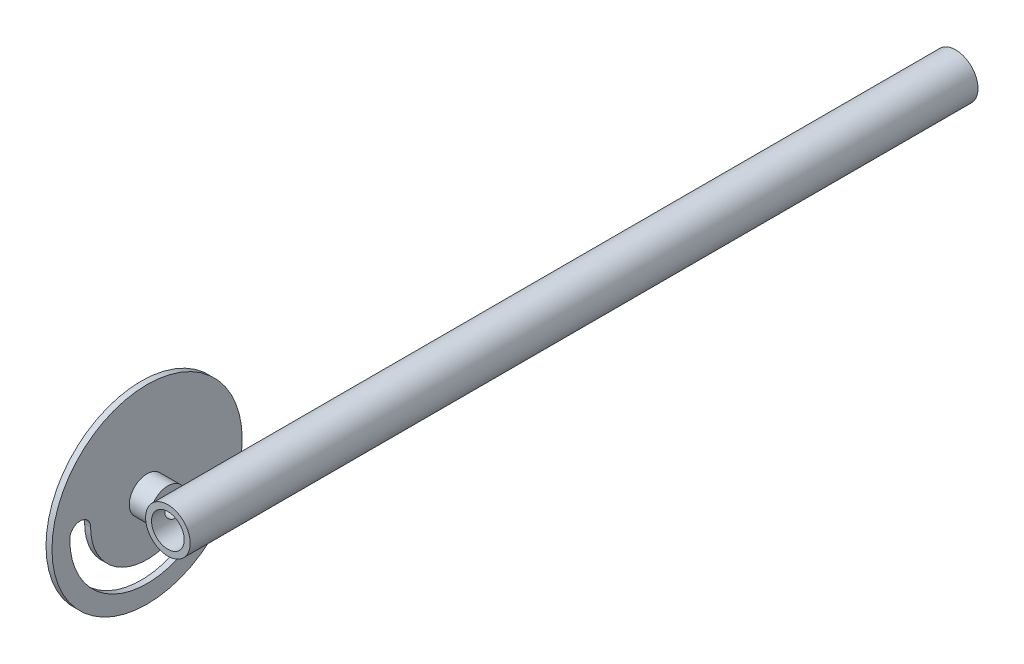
from build123d import *

# Parameters (mm, degrees)
ESQUISSE1_W                         = 2
ESQUISSE1_H                         = 32
ENL_V_MAT_EXTRU_1_DEPTH             = 51.487622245
ESQUISSE3_R                         = 6
BOSS_EXTRU_1_DEPTH                  = 7
ESQUISSE4_W                         = 7.5
ESQUISSE4_H                         = 265
DIAM_TRE_DU_PER_AGE_11_0_11_1_D     = 11
DIAM_TRE_DU_PER_AGE_11_0_11_1_DEPTH = 290
DIAM_TRE_DU_PER_AGE_5_0_5_1_REACH   = 269.958
DIAM_TRE_DU_PER_AGE_5_0_5_1_BORE_R  = 2.5


with BuildPart() as part:
    # Esquisse1 → R_volution1 (revolve)
    with BuildSketch(Plane.XY.offset(-7), mode=Mode.PRIVATE) as r_volution1_sk:
        with Locations((-15, 16)):
            Rectangle(ESQUISSE1_W, ESQUISSE1_H)
    revolve(r_volution1_sk.sketch.rotate(Axis((-16, 0, -7), (1, 0, 0)), 270), axis=Axis((-16, 0, -7), (1, 0, 0)))

    # Esquisse2 → Enl_v. mat.-Extru.1 (cut, through all)
    with BuildSketch(Plane(origin=(-14, 0, 0), x_dir=(0, 0, -1), z_dir=(1, 0, 0))):
        with BuildLine():
            ThreePointArc((-19, 0), (-2.949769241, -24.020867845), (25.384776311, -18.384776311))
            ThreePointArc((25.384776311, -18.384776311), (25.384776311, -13.435028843), (20.435028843, -13.435028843))
            ThreePointArc((20.435028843, -13.435028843), (-0.270985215, -17.553711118), (-12, 0))
            ThreePointArc((-12, 0), (-15.5, 3.5), (-19, 0))
        make_face()
    extrude(amount=-ENL_V_MAT_EXTRU_1_DEPTH, mode=Mode.SUBTRACT)

    # Esquisse3 → Boss.-Extru.1 (add)
    with BuildSketch(Plane(origin=(-14, 0, 0), x_dir=(0, 0, -1), z_dir=(1, 0, 0))):
        with Locations((7, 0)):
            Circle(ESQUISSE3_R)
    extrude(amount=BOSS_EXTRU_1_DEPTH)

    # Esquisse4 → R_volution2 (revolve)
    with BuildSketch(Plane(origin=(0, 0, 0), x_dir=(1, 0, 0), z_dir=(0, 1, 0))):
        with Locations((3.75, 132.5)):
            Rectangle(ESQUISSE4_W, ESQUISSE4_H)
    revolve(axis=Axis((0, 0, -265), (0, 0, 1)))

    # Diam_tre du per_age _11.0 _11_1
    with Locations(Plane(origin=(0, 0, -265), x_dir=(-1, 0, 0), z_dir=(0, 0, -1))):
        with Locations((0, 0)):
            Hole(DIAM_TRE_DU_PER_AGE_11_0_11_1_D / 2, depth=DIAM_TRE_DU_PER_AGE_11_0_11_1_DEPTH)

    # Diam_tre du per_age _5.0 _5_1 bore → Diam_tre du per_age _5.0 _5_1 (cut, up to next)
    with BuildSketch(Plane.ZY.offset(16), mode=Mode.PRIVATE) as diam_tre_du_per_age_5_0_5_1_sk1:
        with Locations((-7, 0)):
            Circle(DIAM_TRE_DU_PER_AGE_5_0_5_1_BORE_R)
    diam_tre_du_per_age_5_0_5_1_tool1 = extrude(diam_tre_du_per_age_5_0_5_1_sk1.sketch, amount=-DIAM_TRE_DU_PER_AGE_5_0_5_1_REACH, mode=Mode.PRIVATE) & part.part
    add(diam_tre_du_per_age_5_0_5_1_tool1.solids().sort_by_distance((-16, 0, -7))[0], mode=Mode.SUBTRACT)


solid = part.part
